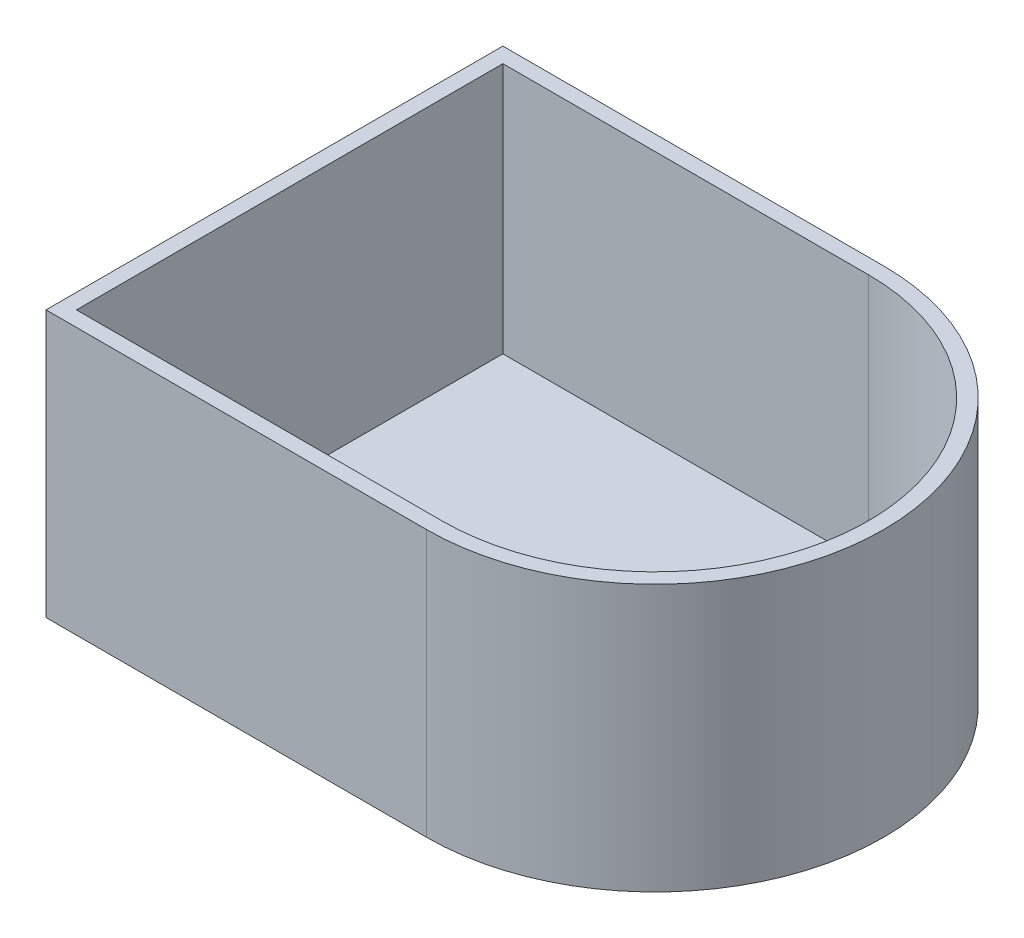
ISO-10303-21;
HEADER;
FILE_DESCRIPTION(('STEP AP214'),'2;1');
FILE_NAME('part.step','',(''),(''),'','','');
FILE_SCHEMA(('AUTOMOTIVE_DESIGN { 1 0 10303 214 1 1 1 1 }'));
ENDSEC;
DATA;
#1=APPLICATION_CONTEXT('core data for automotive mechanical design processes');
#2=APPLICATION_PROTOCOL_DEFINITION('international standard','automotive_design',2000,#1);
#3=PRODUCT_CONTEXT('',#1,'mechanical');
#4=PRODUCT('Part','Part','',(#3));
#5=PRODUCT_RELATED_PRODUCT_CATEGORY('part','',(#4));
#6=PRODUCT_DEFINITION_FORMATION('','',#4);
#7=PRODUCT_DEFINITION_CONTEXT('part definition',#1,'design');
#8=PRODUCT_DEFINITION('design','',#6,#7);
#9=PRODUCT_DEFINITION_SHAPE('','',#8);
#10=(LENGTH_UNIT() NAMED_UNIT(*) SI_UNIT(.MILLI.,.METRE.));
#11=(NAMED_UNIT(*) PLANE_ANGLE_UNIT() SI_UNIT($,.RADIAN.));
#12=(NAMED_UNIT(*) SI_UNIT($,.STERADIAN.) SOLID_ANGLE_UNIT());
#13=UNCERTAINTY_MEASURE_WITH_UNIT(LENGTH_MEASURE(1.E-05),#10,'distance_accuracy_value','');
#14=(GEOMETRIC_REPRESENTATION_CONTEXT(3) GLOBAL_UNCERTAINTY_ASSIGNED_CONTEXT((#13)) GLOBAL_UNIT_ASSIGNED_CONTEXT((#10,
#11,#12)) REPRESENTATION_CONTEXT('',''));
#15=CARTESIAN_POINT('',(0.,0.,0.));
#16=DIRECTION('',(0.,0.,1.));
#17=DIRECTION('',(1.,0.,0.));
#18=AXIS2_PLACEMENT_3D('',#15,#16,#17);
#19=CARTESIAN_POINT('',(-25.,35.,30.));
#20=DIRECTION('',(1.,0.,0.));
#21=DIRECTION('',(0.,0.,-1.));
#22=AXIS2_PLACEMENT_3D('',#19,#20,#21);
#23=PLANE('',#22);
#24=DIRECTION('',(0.,0.,1.));
#25=VECTOR('',#24,1.);
#26=CARTESIAN_POINT('',(-25.,0.,30.));
#27=LINE('',#26,#25);
#28=CARTESIAN_POINT('',(-25.,0.,-30.));
#29=VERTEX_POINT('',#28);
#30=CARTESIAN_POINT('',(-25.,0.,30.));
#31=VERTEX_POINT('',#30);
#32=EDGE_CURVE('E128',#29,#31,#27,.T.);
#33=ORIENTED_EDGE('',*,*,#32,.T.);
#34=DIRECTION('',(0.,-1.,0.));
#35=VECTOR('',#34,1.);
#36=CARTESIAN_POINT('',(-25.,35.,30.));
#37=LINE('',#36,#35);
#38=CARTESIAN_POINT('',(-25.,35.,30.));
#39=VERTEX_POINT('',#38);
#40=EDGE_CURVE('E11',#39,#31,#37,.T.);
#41=ORIENTED_EDGE('',*,*,#40,.F.);
#42=DIRECTION('',(0.,0.,1.));
#43=VECTOR('',#42,1.);
#44=CARTESIAN_POINT('',(-25.,35.,30.));
#45=LINE('',#44,#43);
#46=CARTESIAN_POINT('',(-25.,35.,-30.));
#47=VERTEX_POINT('',#46);
#48=EDGE_CURVE('E137',#47,#39,#45,.T.);
#49=ORIENTED_EDGE('',*,*,#48,.F.);
#50=DIRECTION('',(0.,-1.,0.));
#51=VECTOR('',#50,1.);
#52=CARTESIAN_POINT('',(-25.,35.,-30.));
#53=LINE('',#52,#51);
#54=EDGE_CURVE('E144',#47,#29,#53,.T.);
#55=ORIENTED_EDGE('',*,*,#54,.T.);
#56=EDGE_LOOP('',(#33,#41,#49,#55));
#57=FACE_BOUND('',#56,.T.);
#58=ADVANCED_FACE('F29',(#57),#23,.F.);
#59=CARTESIAN_POINT('',(-25.,35.,30.));
#60=DIRECTION('',(0.,0.,-1.));
#61=DIRECTION('',(-1.,0.,0.));
#62=AXIS2_PLACEMENT_3D('',#59,#60,#61);
#63=PLANE('',#62);
#64=DIRECTION('',(1.,0.,0.));
#65=VECTOR('',#64,1.);
#66=CARTESIAN_POINT('',(-25.,0.,30.));
#67=LINE('',#66,#65);
#68=CARTESIAN_POINT('',(25.,0.,30.));
#69=VERTEX_POINT('',#68);
#70=EDGE_CURVE('E131',#31,#69,#67,.T.);
#71=ORIENTED_EDGE('',*,*,#70,.T.);
#72=DIRECTION('',(0.,-1.,0.));
#73=VECTOR('',#72,1.);
#74=CARTESIAN_POINT('',(25.,35.,30.));
#75=LINE('',#74,#73);
#76=CARTESIAN_POINT('',(25.,35.,30.));
#77=VERTEX_POINT('',#76);
#78=EDGE_CURVE('E36',#77,#69,#75,.T.);
#79=ORIENTED_EDGE('',*,*,#78,.F.);
#80=DIRECTION('',(1.,0.,0.));
#81=VECTOR('',#80,1.);
#82=CARTESIAN_POINT('',(-25.,35.,30.));
#83=LINE('',#82,#81);
#84=EDGE_CURVE('E139',#39,#77,#83,.T.);
#85=ORIENTED_EDGE('',*,*,#84,.F.);
#86=ORIENTED_EDGE('',*,*,#40,.T.);
#87=EDGE_LOOP('',(#71,#79,#85,#86));
#88=FACE_BOUND('',#87,.T.);
#89=ADVANCED_FACE('F167',(#88),#63,.F.);
#90=CARTESIAN_POINT('',(25.,35.,0.));
#91=DIRECTION('',(0.,-1.,0.));
#92=DIRECTION('',(0.,0.,-1.));
#93=AXIS2_PLACEMENT_3D('',#90,#91,#92);
#94=CYLINDRICAL_SURFACE('',#93,30.);
#95=CARTESIAN_POINT('',(25.,0.,0.));
#96=DIRECTION('',(0.,1.,0.));
#97=DIRECTION('',(0.,0.,1.));
#98=AXIS2_PLACEMENT_3D('',#95,#96,#97);
#99=CIRCLE('',#98,30.);
#100=CARTESIAN_POINT('',(25.,0.,-30.));
#101=VERTEX_POINT('',#100);
#102=EDGE_CURVE('E133',#69,#101,#99,.T.);
#103=ORIENTED_EDGE('',*,*,#102,.T.);
#104=DIRECTION('',(0.,-1.,0.));
#105=VECTOR('',#104,1.);
#106=CARTESIAN_POINT('',(25.,35.,-30.));
#107=LINE('',#106,#105);
#108=CARTESIAN_POINT('',(25.,35.,-30.));
#109=VERTEX_POINT('',#108);
#110=EDGE_CURVE('E147',#109,#101,#107,.T.);
#111=ORIENTED_EDGE('',*,*,#110,.F.);
#112=CARTESIAN_POINT('',(25.,35.,0.));
#113=DIRECTION('',(0.,1.,0.));
#114=DIRECTION('',(0.,0.,1.));
#115=AXIS2_PLACEMENT_3D('',#112,#113,#114);
#116=CIRCLE('',#115,30.);
#117=EDGE_CURVE('E141',#77,#109,#116,.T.);
#118=ORIENTED_EDGE('',*,*,#117,.F.);
#119=ORIENTED_EDGE('',*,*,#78,.T.);
#120=EDGE_LOOP('',(#103,#111,#118,#119));
#121=FACE_BOUND('',#120,.T.);
#122=ADVANCED_FACE('F154',(#121),#94,.T.);
#123=CARTESIAN_POINT('',(-25.,35.,-30.));
#124=DIRECTION('',(0.,0.,1.));
#125=DIRECTION('',(1.,0.,0.));
#126=AXIS2_PLACEMENT_3D('',#123,#124,#125);
#127=PLANE('',#126);
#128=DIRECTION('',(-1.,0.,0.));
#129=VECTOR('',#128,1.);
#130=CARTESIAN_POINT('',(-25.,0.,-30.));
#131=LINE('',#130,#129);
#132=EDGE_CURVE('E135',#101,#29,#131,.T.);
#133=ORIENTED_EDGE('',*,*,#132,.T.);
#134=ORIENTED_EDGE('',*,*,#54,.F.);
#135=DIRECTION('',(-1.,0.,0.));
#136=VECTOR('',#135,1.);
#137=CARTESIAN_POINT('',(-25.,35.,-30.));
#138=LINE('',#137,#136);
#139=EDGE_CURVE('E51',#109,#47,#138,.T.);
#140=ORIENTED_EDGE('',*,*,#139,.F.);
#141=ORIENTED_EDGE('',*,*,#110,.T.);
#142=EDGE_LOOP('',(#133,#134,#140,#141));
#143=FACE_BOUND('',#142,.T.);
#144=ADVANCED_FACE('F162',(#143),#127,.F.);
#145=CARTESIAN_POINT('',(25.,35.,0.));
#146=DIRECTION('',(0.,1.,0.));
#147=DIRECTION('',(0.,0.,1.));
#148=AXIS2_PLACEMENT_3D('',#145,#146,#147);
#149=PLANE('',#148);
#150=DIRECTION('',(0.,0.,1.));
#151=VECTOR('',#150,1.);
#152=CARTESIAN_POINT('',(-23.,35.,30.));
#153=LINE('',#152,#151);
#154=CARTESIAN_POINT('',(-23.,35.,-28.));
#155=VERTEX_POINT('',#154);
#156=CARTESIAN_POINT('',(-23.,35.,28.));
#157=VERTEX_POINT('',#156);
#158=EDGE_CURVE('E117',#155,#157,#153,.T.);
#159=ORIENTED_EDGE('',*,*,#158,.F.);
#160=DIRECTION('',(-1.,0.,0.));
#161=VECTOR('',#160,1.);
#162=CARTESIAN_POINT('',(-25.,35.,-28.));
#163=LINE('',#162,#161);
#164=CARTESIAN_POINT('',(25.,35.,-28.));
#165=VERTEX_POINT('',#164);
#166=EDGE_CURVE('E126',#165,#155,#163,.T.);
#167=ORIENTED_EDGE('',*,*,#166,.F.);
#168=CARTESIAN_POINT('',(25.,35.,0.));
#169=DIRECTION('',(0.,1.,0.));
#170=DIRECTION('',(0.,0.,1.));
#171=AXIS2_PLACEMENT_3D('',#168,#169,#170);
#172=CIRCLE('',#171,28.);
#173=CARTESIAN_POINT('',(25.,35.,28.));
#174=VERTEX_POINT('',#173);
#175=EDGE_CURVE('E124',#174,#165,#172,.T.);
#176=ORIENTED_EDGE('',*,*,#175,.F.);
#177=DIRECTION('',(1.,0.,0.));
#178=VECTOR('',#177,1.);
#179=CARTESIAN_POINT('',(-25.,35.,28.));
#180=LINE('',#179,#178);
#181=EDGE_CURVE('E109',#157,#174,#180,.T.);
#182=ORIENTED_EDGE('',*,*,#181,.F.);
#183=EDGE_LOOP('',(#159,#167,#176,#182));
#184=FACE_BOUND('',#183,.T.);
#185=ORIENTED_EDGE('',*,*,#48,.T.);
#186=ORIENTED_EDGE('',*,*,#84,.T.);
#187=ORIENTED_EDGE('',*,*,#117,.T.);
#188=ORIENTED_EDGE('',*,*,#139,.T.);
#189=EDGE_LOOP('',(#185,#186,#187,#188));
#190=FACE_BOUND('',#189,.T.);
#191=ADVANCED_FACE('F166',(#184,#190),#149,.T.);
#192=CARTESIAN_POINT('',(25.,0.,0.));
#193=DIRECTION('',(0.,1.,0.));
#194=DIRECTION('',(0.,0.,1.));
#195=AXIS2_PLACEMENT_3D('',#192,#193,#194);
#196=PLANE('',#195);
#197=ORIENTED_EDGE('',*,*,#32,.F.);
#198=ORIENTED_EDGE('',*,*,#132,.F.);
#199=ORIENTED_EDGE('',*,*,#102,.F.);
#200=ORIENTED_EDGE('',*,*,#70,.F.);
#201=EDGE_LOOP('',(#197,#198,#199,#200));
#202=FACE_BOUND('',#201,.T.);
#203=ADVANCED_FACE('F160',(#202),#196,.F.);
#204=CARTESIAN_POINT('',(-23.,35.,30.));
#205=DIRECTION('',(1.,0.,0.));
#206=DIRECTION('',(0.,0.,-1.));
#207=AXIS2_PLACEMENT_3D('',#204,#205,#206);
#208=PLANE('',#207);
#209=DIRECTION('',(0.,0.,1.));
#210=VECTOR('',#209,1.);
#211=CARTESIAN_POINT('',(-23.,2.,30.));
#212=LINE('',#211,#210);
#213=CARTESIAN_POINT('',(-23.,2.,-28.));
#214=VERTEX_POINT('',#213);
#215=CARTESIAN_POINT('',(-23.,2.,28.));
#216=VERTEX_POINT('',#215);
#217=EDGE_CURVE('E100',#214,#216,#212,.T.);
#218=ORIENTED_EDGE('',*,*,#217,.F.);
#219=DIRECTION('',(0.,-1.,0.));
#220=VECTOR('',#219,1.);
#221=CARTESIAN_POINT('',(-23.,35.,-28.));
#222=LINE('',#221,#220);
#223=EDGE_CURVE('E120',#155,#214,#222,.T.);
#224=ORIENTED_EDGE('',*,*,#223,.F.);
#225=ORIENTED_EDGE('',*,*,#158,.T.);
#226=DIRECTION('',(0.,-1.,0.));
#227=VECTOR('',#226,1.);
#228=CARTESIAN_POINT('',(-23.,35.,28.));
#229=LINE('',#228,#227);
#230=EDGE_CURVE('E112',#157,#216,#229,.T.);
#231=ORIENTED_EDGE('',*,*,#230,.T.);
#232=EDGE_LOOP('',(#218,#224,#225,#231));
#233=FACE_BOUND('',#232,.T.);
#234=ADVANCED_FACE('F182',(#233),#208,.T.);
#235=CARTESIAN_POINT('',(-25.,35.,28.));
#236=DIRECTION('',(0.,0.,-1.));
#237=DIRECTION('',(-1.,0.,0.));
#238=AXIS2_PLACEMENT_3D('',#235,#236,#237);
#239=PLANE('',#238);
#240=DIRECTION('',(1.,0.,0.));
#241=VECTOR('',#240,1.);
#242=CARTESIAN_POINT('',(-25.,2.,28.));
#243=LINE('',#242,#241);
#244=CARTESIAN_POINT('',(25.,2.,28.));
#245=VERTEX_POINT('',#244);
#246=EDGE_CURVE('E94',#216,#245,#243,.T.);
#247=ORIENTED_EDGE('',*,*,#246,.F.);
#248=ORIENTED_EDGE('',*,*,#230,.F.);
#249=ORIENTED_EDGE('',*,*,#181,.T.);
#250=DIRECTION('',(0.,-1.,0.));
#251=VECTOR('',#250,1.);
#252=CARTESIAN_POINT('',(25.,35.,28.));
#253=LINE('',#252,#251);
#254=EDGE_CURVE('E106',#174,#245,#253,.T.);
#255=ORIENTED_EDGE('',*,*,#254,.T.);
#256=EDGE_LOOP('',(#247,#248,#249,#255));
#257=FACE_BOUND('',#256,.T.);
#258=ADVANCED_FACE('F107',(#257),#239,.T.);
#259=CARTESIAN_POINT('',(25.,35.,0.));
#260=DIRECTION('',(0.,-1.,0.));
#261=DIRECTION('',(0.,0.,-1.));
#262=AXIS2_PLACEMENT_3D('',#259,#260,#261);
#263=CYLINDRICAL_SURFACE('',#262,28.);
#264=CARTESIAN_POINT('',(25.,2.,0.));
#265=DIRECTION('',(0.,1.,0.));
#266=DIRECTION('',(0.,0.,1.));
#267=AXIS2_PLACEMENT_3D('',#264,#265,#266);
#268=CIRCLE('',#267,28.);
#269=CARTESIAN_POINT('',(25.,2.,-28.));
#270=VERTEX_POINT('',#269);
#271=EDGE_CURVE('E98',#245,#270,#268,.T.);
#272=ORIENTED_EDGE('',*,*,#271,.F.);
#273=ORIENTED_EDGE('',*,*,#254,.F.);
#274=ORIENTED_EDGE('',*,*,#175,.T.);
#275=DIRECTION('',(0.,1.,0.));
#276=VECTOR('',#275,1.);
#277=CARTESIAN_POINT('',(25.,35.,-28.));
#278=LINE('',#277,#276);
#279=EDGE_CURVE('E43',#165,#270,#278,.F.);
#280=ORIENTED_EDGE('',*,*,#279,.T.);
#281=EDGE_LOOP('',(#272,#273,#274,#280));
#282=FACE_BOUND('',#281,.T.);
#283=ADVANCED_FACE('F114',(#282),#263,.F.);
#284=CARTESIAN_POINT('',(-25.,35.,-28.));
#285=DIRECTION('',(0.,0.,1.));
#286=DIRECTION('',(1.,0.,0.));
#287=AXIS2_PLACEMENT_3D('',#284,#285,#286);
#288=PLANE('',#287);
#289=DIRECTION('',(-1.,0.,0.));
#290=VECTOR('',#289,1.);
#291=CARTESIAN_POINT('',(-25.,2.,-28.));
#292=LINE('',#291,#290);
#293=EDGE_CURVE('E115',#270,#214,#292,.T.);
#294=ORIENTED_EDGE('',*,*,#293,.F.);
#295=ORIENTED_EDGE('',*,*,#279,.F.);
#296=ORIENTED_EDGE('',*,*,#166,.T.);
#297=ORIENTED_EDGE('',*,*,#223,.T.);
#298=EDGE_LOOP('',(#294,#295,#296,#297));
#299=FACE_BOUND('',#298,.T.);
#300=ADVANCED_FACE('F185',(#299),#288,.T.);
#301=CARTESIAN_POINT('',(25.,2.,0.));
#302=DIRECTION('',(0.,1.,0.));
#303=DIRECTION('',(0.,0.,1.));
#304=AXIS2_PLACEMENT_3D('',#301,#302,#303);
#305=PLANE('',#304);
#306=ORIENTED_EDGE('',*,*,#217,.T.);
#307=ORIENTED_EDGE('',*,*,#246,.T.);
#308=ORIENTED_EDGE('',*,*,#271,.T.);
#309=ORIENTED_EDGE('',*,*,#293,.T.);
#310=EDGE_LOOP('',(#306,#307,#308,#309));
#311=FACE_BOUND('',#310,.T.);
#312=ADVANCED_FACE('F96',(#311),#305,.T.);
#313=CLOSED_SHELL('',(#58,#89,#122,#144,#191,#203,#234,#258,#283,#300,#312));
#314=MANIFOLD_SOLID_BREP('B2',#313);
#315=ADVANCED_BREP_SHAPE_REPRESENTATION('',(#18,#314),#14);
#316=SHAPE_DEFINITION_REPRESENTATION(#9,#315);
ENDSEC;
END-ISO-10303-21;
